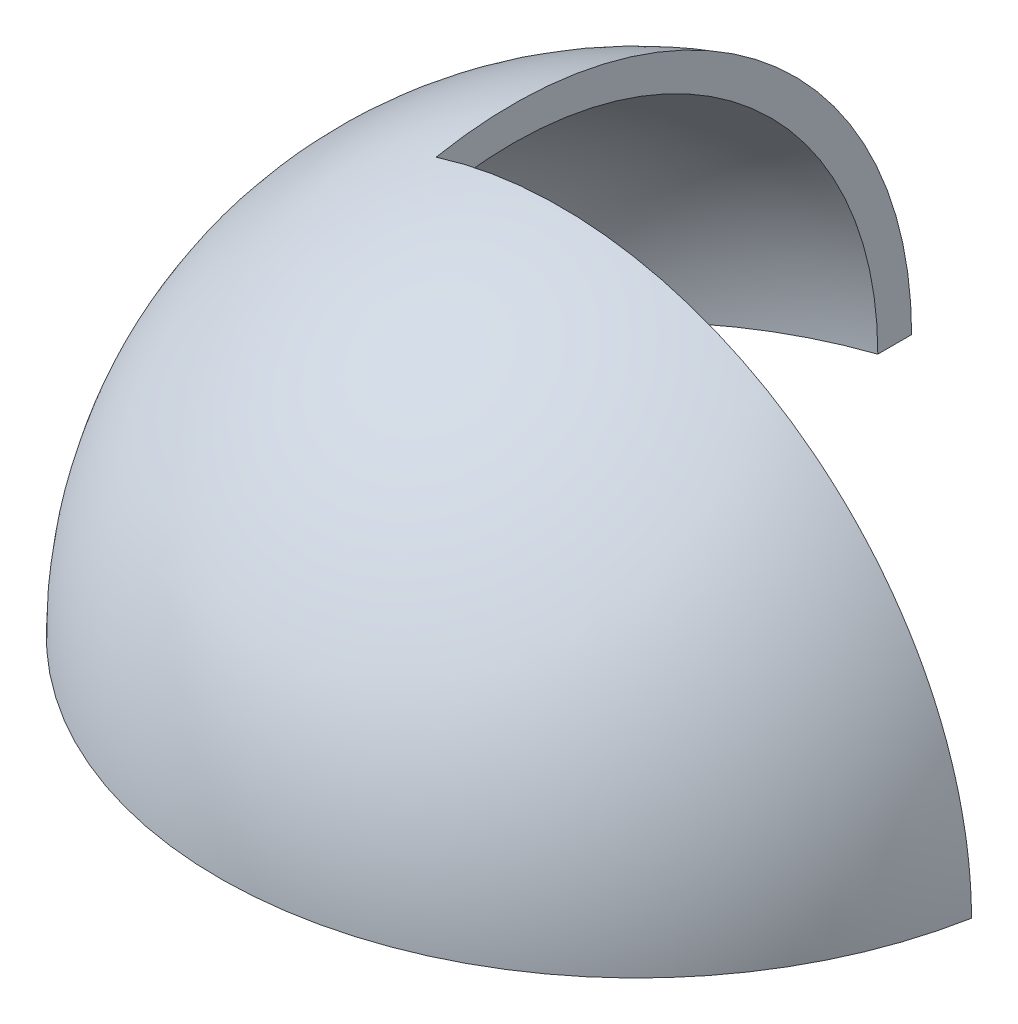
ISO-10303-21;
HEADER;
FILE_DESCRIPTION(('STEP AP214'),'2;1');
FILE_NAME('part.step','',(''),(''),'','','');
FILE_SCHEMA(('AUTOMOTIVE_DESIGN { 1 0 10303 214 1 1 1 1 }'));
ENDSEC;
DATA;
#1=APPLICATION_CONTEXT('core data for automotive mechanical design processes');
#2=APPLICATION_PROTOCOL_DEFINITION('international standard','automotive_design',2000,#1);
#3=PRODUCT_CONTEXT('',#1,'mechanical');
#4=PRODUCT('Part','Part','',(#3));
#5=PRODUCT_RELATED_PRODUCT_CATEGORY('part','',(#4));
#6=PRODUCT_DEFINITION_FORMATION('','',#4);
#7=PRODUCT_DEFINITION_CONTEXT('part definition',#1,'design');
#8=PRODUCT_DEFINITION('design','',#6,#7);
#9=PRODUCT_DEFINITION_SHAPE('','',#8);
#10=(LENGTH_UNIT() NAMED_UNIT(*) SI_UNIT(.MILLI.,.METRE.));
#11=(NAMED_UNIT(*) PLANE_ANGLE_UNIT() SI_UNIT($,.RADIAN.));
#12=(NAMED_UNIT(*) SI_UNIT($,.STERADIAN.) SOLID_ANGLE_UNIT());
#13=UNCERTAINTY_MEASURE_WITH_UNIT(LENGTH_MEASURE(1.E-05),#10,'distance_accuracy_value','');
#14=(GEOMETRIC_REPRESENTATION_CONTEXT(3) GLOBAL_UNCERTAINTY_ASSIGNED_CONTEXT((#13)) GLOBAL_UNIT_ASSIGNED_CONTEXT((#10,
#11,#12)) REPRESENTATION_CONTEXT('',''));
#15=CARTESIAN_POINT('',(0.,0.,0.));
#16=DIRECTION('',(0.,0.,1.));
#17=DIRECTION('',(1.,0.,0.));
#18=AXIS2_PLACEMENT_3D('',#15,#16,#17);
#19=CARTESIAN_POINT('',(0.,0.,0.));
#20=DIRECTION('',(-1.,0.,0.));
#21=DIRECTION('',(0.,0.,-1.));
#22=AXIS2_PLACEMENT_3D('',#19,#20,#21);
#23=SPHERICAL_SURFACE('',#22,60.);
#24=CARTESIAN_POINT('',(-19.3714677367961,0.,0.));
#25=DIRECTION('',(1.,0.,0.));
#26=DIRECTION('',(0.,0.,-1.));
#27=AXIS2_PLACEMENT_3D('',#24,#25,#26);
#28=CIRCLE('',#27,56.7868491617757);
#29=CARTESIAN_POINT('',(-19.3714677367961,55.5218953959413,11.9191178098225));
#30=VERTEX_POINT('',#29);
#31=CARTESIAN_POINT('',(-19.3714677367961,3.9654044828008E-13,-56.7868491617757));
#32=VERTEX_POINT('',#31);
#33=EDGE_CURVE('E56',#30,#32,#28,.F.);
#34=ORIENTED_EDGE('',*,*,#33,.F.);
#35=CARTESIAN_POINT('',(0.,0.,11.9191178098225));
#36=DIRECTION('',(0.,0.,-1.));
#37=DIRECTION('',(-1.,0.,0.));
#38=AXIS2_PLACEMENT_3D('',#35,#36,#37);
#39=CIRCLE('',#38,58.8042058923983);
#40=CARTESIAN_POINT('',(58.8042058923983,0.,11.9191178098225));
#41=VERTEX_POINT('',#40);
#42=EDGE_CURVE('E73',#41,#30,#39,.F.);
#43=ORIENTED_EDGE('',*,*,#42,.F.);
#44=CARTESIAN_POINT('',(0.,0.,0.));
#45=DIRECTION('',(0.,1.,0.));
#46=DIRECTION('',(0.,0.,-1.));
#47=AXIS2_PLACEMENT_3D('',#44,#45,#46);
#48=CIRCLE('',#47,60.);
#49=EDGE_CURVE('E83',#32,#41,#48,.T.);
#50=ORIENTED_EDGE('',*,*,#49,.F.);
#51=EDGE_LOOP('',(#34,#43,#50));
#52=FACE_BOUND('',#51,.T.);
#53=ADVANCED_FACE('F33',(#52),#23,.F.);
#54=CARTESIAN_POINT('',(0.,0.,0.));
#55=DIRECTION('',(-1.,0.,0.));
#56=DIRECTION('',(0.,0.,-1.));
#57=AXIS2_PLACEMENT_3D('',#54,#55,#56);
#58=SPHERICAL_SURFACE('',#57,65.);
#59=CARTESIAN_POINT('',(-19.3714677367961,0.,0.));
#60=DIRECTION('',(1.,0.,0.));
#61=DIRECTION('',(0.,0.,-1.));
#62=AXIS2_PLACEMENT_3D('',#59,#60,#61);
#63=CIRCLE('',#62,62.0463233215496);
#64=CARTESIAN_POINT('',(-19.3714677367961,4.33267160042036E-13,-62.0463233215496));
#65=VERTEX_POINT('',#64);
#66=CARTESIAN_POINT('',(-19.3714677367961,60.8907289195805,11.9191178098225));
#67=VERTEX_POINT('',#66);
#68=EDGE_CURVE('E67',#65,#67,#63,.T.);
#69=ORIENTED_EDGE('',*,*,#68,.F.);
#70=CARTESIAN_POINT('',(0.,0.,0.));
#71=DIRECTION('',(0.,-1.,0.));
#72=DIRECTION('',(0.,0.,-1.));
#73=AXIS2_PLACEMENT_3D('',#70,#71,#72);
#74=CIRCLE('',#73,65.);
#75=CARTESIAN_POINT('',(63.8978452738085,0.,11.9191178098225));
#76=VERTEX_POINT('',#75);
#77=EDGE_CURVE('E78',#76,#65,#74,.T.);
#78=ORIENTED_EDGE('',*,*,#77,.F.);
#79=CARTESIAN_POINT('',(0.,0.,11.9191178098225));
#80=DIRECTION('',(0.,0.,-1.));
#81=DIRECTION('',(-1.,0.,0.));
#82=AXIS2_PLACEMENT_3D('',#79,#80,#81);
#83=CIRCLE('',#82,63.8978452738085);
#84=EDGE_CURVE('E48',#67,#76,#83,.T.);
#85=ORIENTED_EDGE('',*,*,#84,.F.);
#86=EDGE_LOOP('',(#69,#78,#85));
#87=FACE_BOUND('',#86,.T.);
#88=ADVANCED_FACE('F35',(#87),#58,.T.);
#89=CARTESIAN_POINT('',(0.,0.,0.));
#90=DIRECTION('',(0.,-1.,0.));
#91=DIRECTION('',(0.,0.,-1.));
#92=AXIS2_PLACEMENT_3D('',#89,#90,#91);
#93=PLANE('',#92);
#94=ORIENTED_EDGE('',*,*,#77,.T.);
#95=DIRECTION('',(0.,0.,1.));
#96=VECTOR('',#95,1.);
#97=CARTESIAN_POINT('',(-19.3714677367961,0.,0.));
#98=LINE('',#97,#96);
#99=EDGE_CURVE('E11',#65,#32,#98,.T.);
#100=ORIENTED_EDGE('',*,*,#99,.T.);
#101=ORIENTED_EDGE('',*,*,#49,.T.);
#102=DIRECTION('',(1.,0.,0.));
#103=VECTOR('',#102,1.);
#104=CARTESIAN_POINT('',(0.,0.,11.9191178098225));
#105=LINE('',#104,#103);
#106=EDGE_CURVE('E41',#41,#76,#105,.T.);
#107=ORIENTED_EDGE('',*,*,#106,.T.);
#108=EDGE_LOOP('',(#94,#100,#101,#107));
#109=FACE_BOUND('',#108,.T.);
#110=ADVANCED_FACE('F87',(#109),#93,.T.);
#111=CARTESIAN_POINT('',(-19.3714677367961,65.,-84.913019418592));
#112=DIRECTION('',(1.,0.,0.));
#113=DIRECTION('',(0.,0.,-1.));
#114=AXIS2_PLACEMENT_3D('',#111,#112,#113);
#115=PLANE('',#114);
#116=ORIENTED_EDGE('',*,*,#33,.T.);
#117=ORIENTED_EDGE('',*,*,#99,.F.);
#118=ORIENTED_EDGE('',*,*,#68,.T.);
#119=DIRECTION('',(0.,-1.,0.));
#120=VECTOR('',#119,1.);
#121=CARTESIAN_POINT('',(-19.3714677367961,65.,11.9191178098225));
#122=LINE('',#121,#120);
#123=EDGE_CURVE('E69',#67,#30,#122,.T.);
#124=ORIENTED_EDGE('',*,*,#123,.T.);
#125=EDGE_LOOP('',(#116,#117,#118,#124));
#126=FACE_BOUND('',#125,.T.);
#127=ADVANCED_FACE('F68',(#126),#115,.T.);
#128=CARTESIAN_POINT('',(-19.3714677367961,65.,11.9191178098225));
#129=DIRECTION('',(0.,0.,-1.));
#130=DIRECTION('',(-1.,0.,0.));
#131=AXIS2_PLACEMENT_3D('',#128,#129,#130);
#132=PLANE('',#131);
#133=ORIENTED_EDGE('',*,*,#42,.T.);
#134=ORIENTED_EDGE('',*,*,#123,.F.);
#135=ORIENTED_EDGE('',*,*,#84,.T.);
#136=ORIENTED_EDGE('',*,*,#106,.F.);
#137=EDGE_LOOP('',(#133,#134,#135,#136));
#138=FACE_BOUND('',#137,.T.);
#139=ADVANCED_FACE('F75',(#138),#132,.T.);
#140=CLOSED_SHELL('',(#53,#88,#110,#127,#139));
#141=MANIFOLD_SOLID_BREP('B2',#140);
#142=ADVANCED_BREP_SHAPE_REPRESENTATION('',(#18,#141),#14);
#143=SHAPE_DEFINITION_REPRESENTATION(#9,#142);
ENDSEC;
END-ISO-10303-21;
